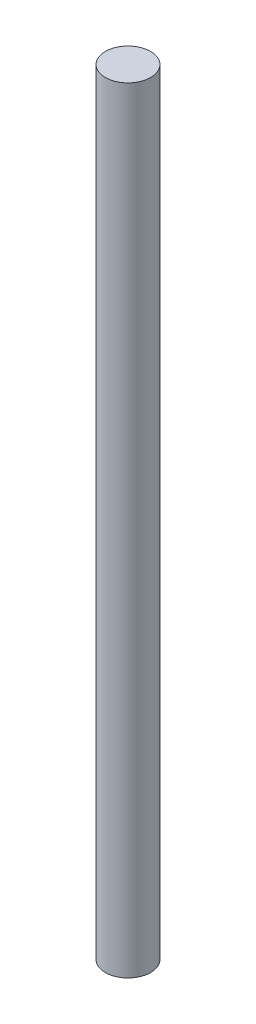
from build123d import *

# Parameters (mm, degrees)
ESQUISSE1_R      = 3.5
EXTRUSION1_DEPTH = 120


with BuildPart() as part:
    # Esquisse1 → Extrusion1 (new body)
    with BuildSketch(Plane(origin=(0, 0, 0), x_dir=(1, 0, 0), z_dir=(0, 1, 0))):
        with Locations(Location((0, 0, 0), (0, 0, 270))):
            Circle(ESQUISSE1_R)
    extrude(amount=EXTRUSION1_DEPTH)


solid = part.part
